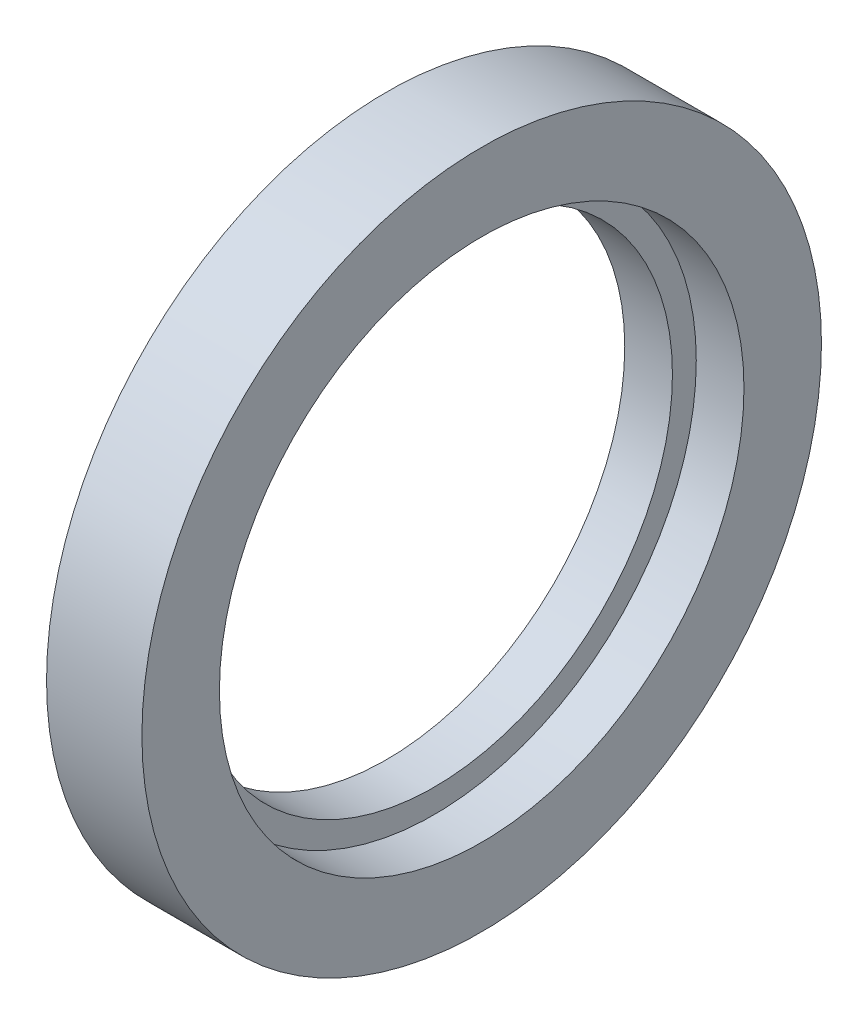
from build123d import *

# Parameters (mm, degrees)
SKETCH1_R           = 71.25
SKETCH1_R_2         = 50
BOSS_EXTRUDE1_DEPTH = 20
SKETCH2_R           = 55
CUT_EXTRUDE1_DEPTH  = 10


with BuildPart() as part:
    # Sketch1 → Boss-Extrude1 (new body)
    with BuildSketch(Plane(origin=(0, 0, 0), x_dir=(0, 0, -1), z_dir=(1, 0, 0))):
        Circle(SKETCH1_R)
        Circle(SKETCH1_R_2, mode=Mode.SUBTRACT)
    extrude(amount=BOSS_EXTRUDE1_DEPTH)

    # Sketch2 → Cut-Extrude1 (cut)
    with BuildSketch(Plane(origin=(20, 0, 0), x_dir=(0, 0, -1), z_dir=(1, 0, 0))):
        Circle(SKETCH2_R)
    extrude(amount=-CUT_EXTRUDE1_DEPTH, mode=Mode.SUBTRACT)


solid = part.part
